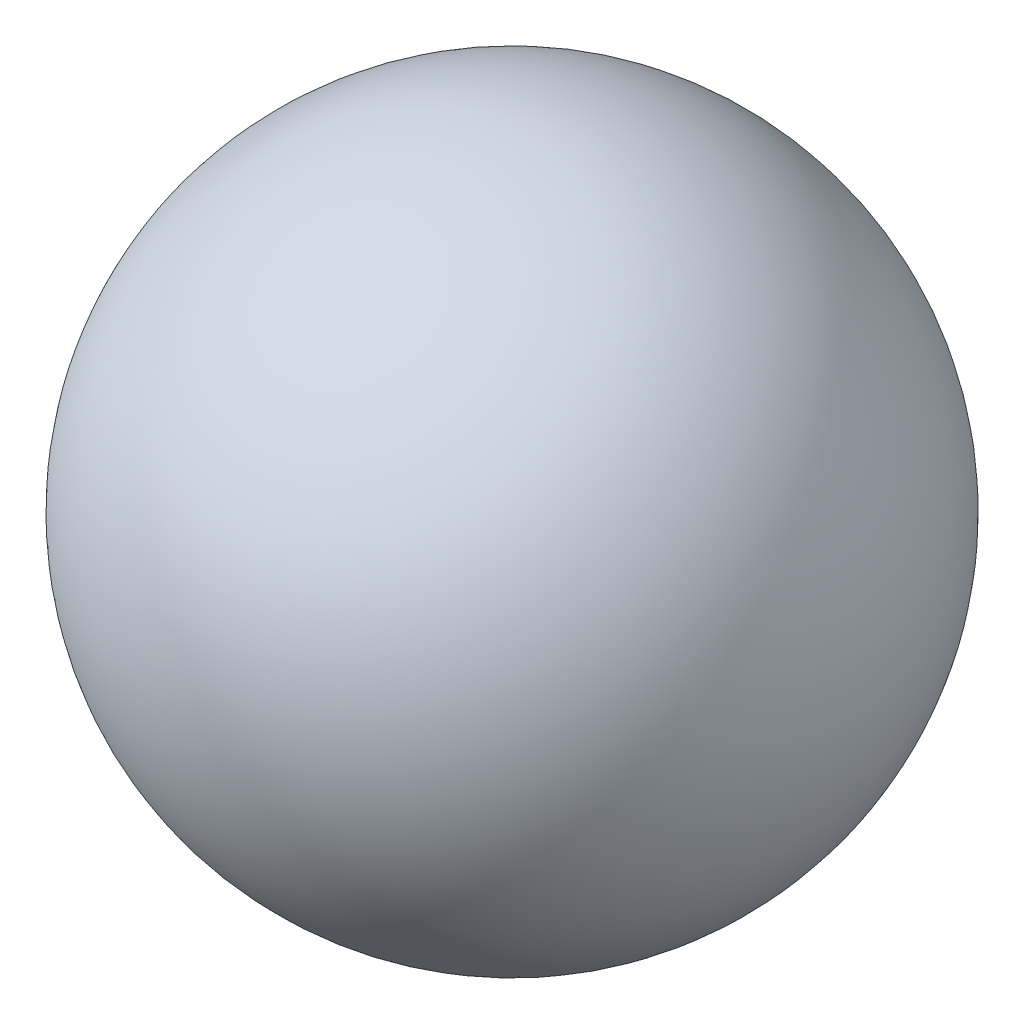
from build123d import *


with BuildPart() as part:
    # Esquisse1 → Base-R_volution (revolve)
    with BuildSketch(Plane(origin=(0, 0, 0), x_dir=(1, 0, 0), z_dir=(0, 1, 0))):
        with BuildLine():
            Line((0.85, 1.95), (3.55, 1.95))
            ThreePointArc((3.55, 1.95), (2.2, 3.3), (0.85, 1.95))
        make_face()
    revolve(axis=Axis((-0.3, 0, -1.95), (1, 0, 0)))


solid = part.part
